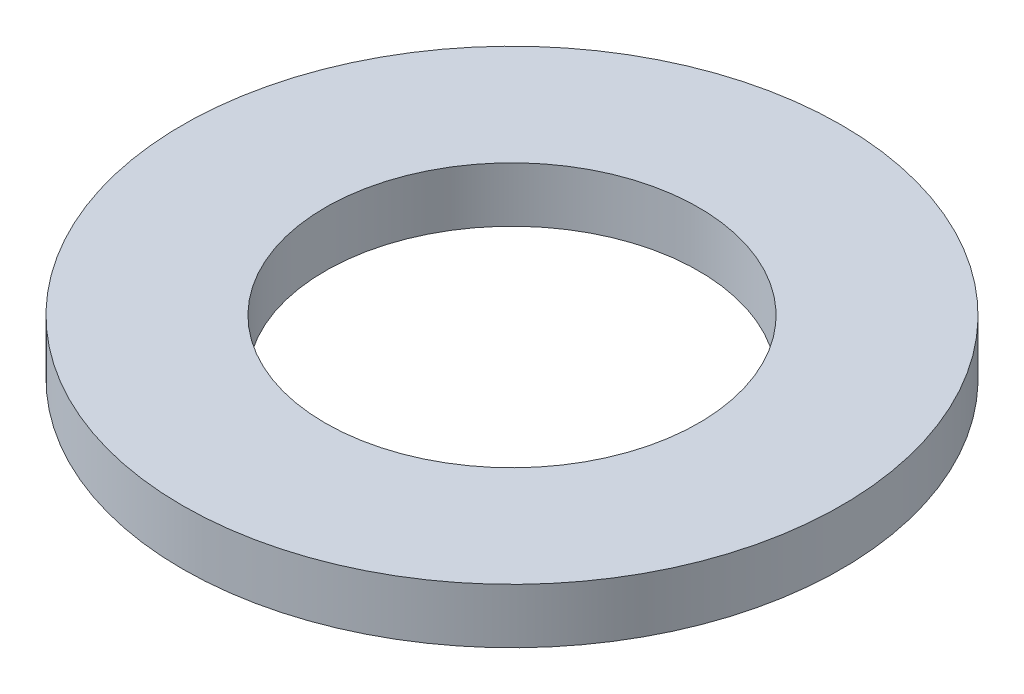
from build123d import *

# Parameters (mm, degrees)
SKETCH1_R      = 30
SKETCH1_R_2    = 17
EXTRUDE1_DEPTH = 5


with BuildPart() as part:
    # Sketch1 → Extrude1 (new body)
    with BuildSketch(Plane(origin=(0, 0, 0), x_dir=(1, 0, 0), z_dir=(0, 1, 0))):
        with Locations(Location((0, 0, 0), (0, 0, 270))):
            Circle(SKETCH1_R)
        with Locations(Location((0, 0, 0), (0, 0, 270))):
            Circle(SKETCH1_R_2, mode=Mode.SUBTRACT)
    extrude(amount=EXTRUDE1_DEPTH)


solid = part.part
